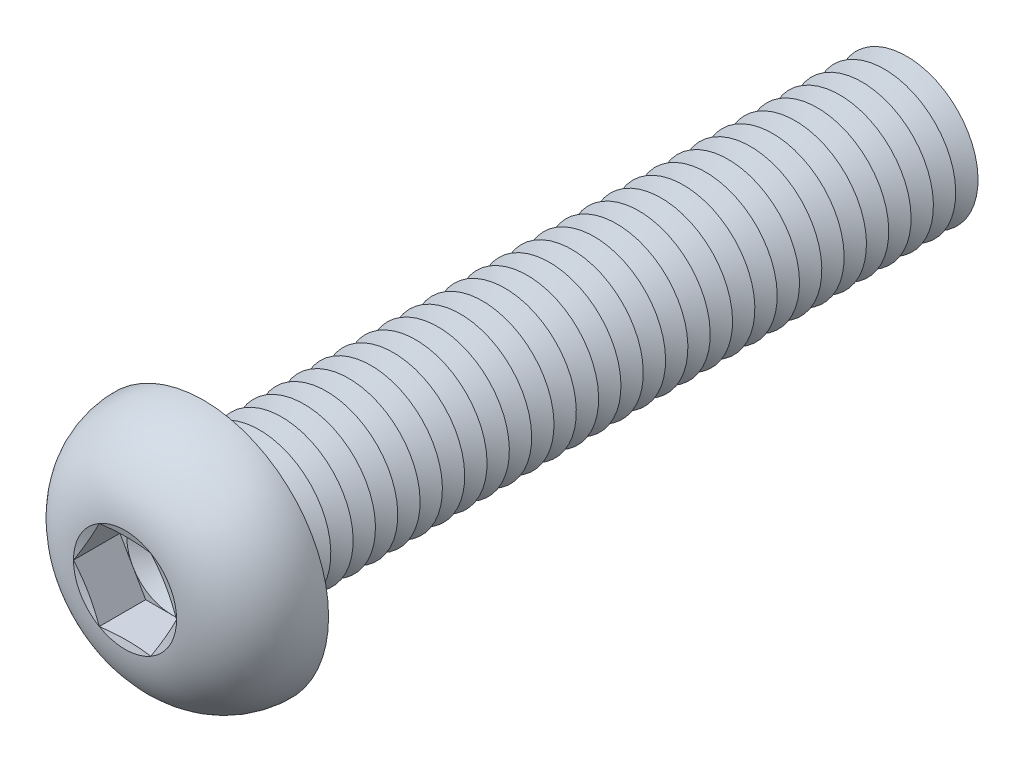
from build123d import *

# Parameters (mm, degrees)
FILLET1_R          = 0.625
LPATTERN1_COUNT    = 32
LPATTERN1_PITCH    = 1.25
CUT_EXTRUDE1_DEPTH = 2.6


with BuildPart() as part:
    # Sketch1 → Revolve1 (revolve)
    with BuildSketch(Plane(origin=(0, 0, 0), x_dir=(0, 0, -1), z_dir=(1, 0, 0))):
        with BuildLine():
            Line((0, 4), (0, 7))
            ThreePointArc((0, 7), (-3.011595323, 5.81154966), (-4.4, 2.88675))
            Line((-4.4, 2.88675), (-4.013248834, 1.443375))
            Line((-4.013248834, 1.443375), (-4.4, 1.443375))
            Line((-4.4, 1.443375), (-4.4, 0))
            Line((-4.4, 0), (40, 0))
            Line((40, 0), (40, 4))
            Line((40, 4), (0, 4))
        make_face()
    revolve(axis=Axis((0, 0, -40), (0, 0, 1)))

    # Fillet1
    fillet1_edges = [part.edges().sort_by_distance(p)[0] for p in [
        (0, -4, 0),
    ]]
    fillet(fillet1_edges, radius=FILLET1_R)

    # Sketch2 → Cut-Revolve1 (revolve, cut)
    with BuildSketch(Plane(origin=(0, 0, 0), x_dir=(0, 0, -1), z_dir=(1, 0, 0))):
        Polygon((39.375, 4), (40.625, 4), (40, 2.917468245), align=None)
    cut_revolve1 = revolve(axis=Axis((0, 0, -40), (0, 0, -1)), mode=Mode.SUBTRACT)

    # LPattern1: Cut-Revolve1 ×32
    with Locations(*[(0, 0, i * LPATTERN1_PITCH) for i in range(1, LPATTERN1_COUNT)]):
        add(cut_revolve1, mode=Mode.SUBTRACT)

    # Sketch3 → Cut-Extrude1 (cut)
    with BuildSketch(Plane.XY.offset(4.4)):
        Polygon((1.443375, 2.499998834), (-1.443375, 2.499998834), (-2.88675, 0), (-1.443375, -2.499998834), (1.443375, -2.499998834), (2.88675, 0), align=None)
    extrude(amount=-CUT_EXTRUDE1_DEPTH, mode=Mode.SUBTRACT)

    # Cut-Extrude2 cone 1 section (on through the dimple's axis) → Cut-Extrude2 (revolve, cut)
    with BuildSketch(Plane(origin=(0, 0, 1.8), x_dir=(0, -1, 0), z_dir=(1, 0, 0))):
        Polygon((0, 0), (2.499998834, 0), (0, 1.443375), align=None)
    revolve(axis=Axis((0, 0, 1.8), (0, 0, -1)), mode=Mode.SUBTRACT)


solid = part.part
